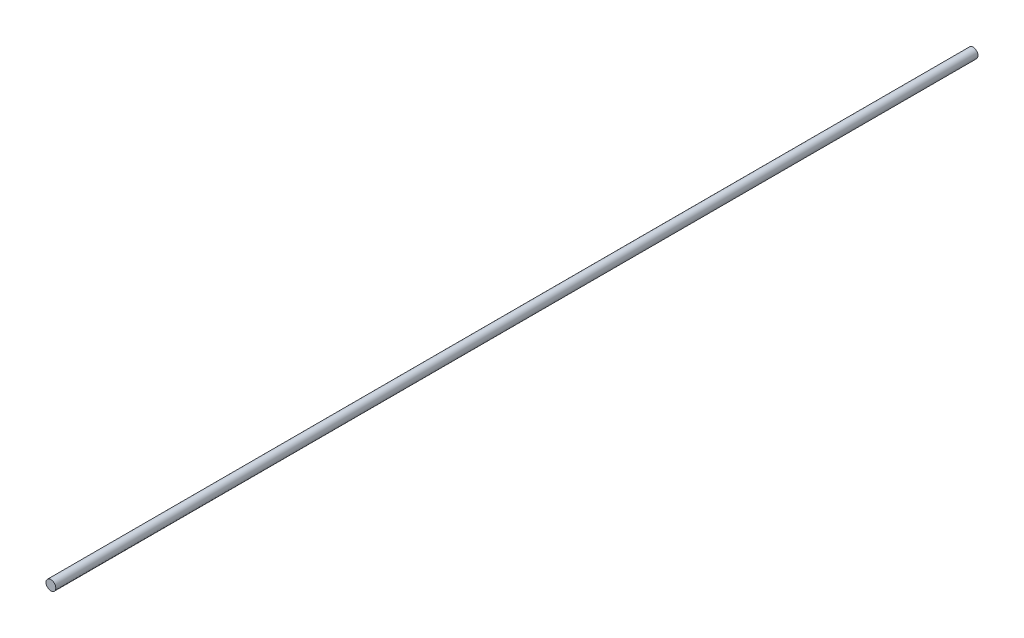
ISO-10303-21;
HEADER;
FILE_DESCRIPTION(('STEP AP214'),'2;1');
FILE_NAME('part.step','',(''),(''),'','','');
FILE_SCHEMA(('AUTOMOTIVE_DESIGN { 1 0 10303 214 1 1 1 1 }'));
ENDSEC;
DATA;
#1=APPLICATION_CONTEXT('core data for automotive mechanical design processes');
#2=APPLICATION_PROTOCOL_DEFINITION('international standard','automotive_design',2000,#1);
#3=PRODUCT_CONTEXT('',#1,'mechanical');
#4=PRODUCT('Part','Part','',(#3));
#5=PRODUCT_RELATED_PRODUCT_CATEGORY('part','',(#4));
#6=PRODUCT_DEFINITION_FORMATION('','',#4);
#7=PRODUCT_DEFINITION_CONTEXT('part definition',#1,'design');
#8=PRODUCT_DEFINITION('design','',#6,#7);
#9=PRODUCT_DEFINITION_SHAPE('','',#8);
#10=(LENGTH_UNIT() NAMED_UNIT(*) SI_UNIT(.MILLI.,.METRE.));
#11=(NAMED_UNIT(*) PLANE_ANGLE_UNIT() SI_UNIT($,.RADIAN.));
#12=(NAMED_UNIT(*) SI_UNIT($,.STERADIAN.) SOLID_ANGLE_UNIT());
#13=UNCERTAINTY_MEASURE_WITH_UNIT(LENGTH_MEASURE(1.E-05),#10,'distance_accuracy_value','');
#14=(GEOMETRIC_REPRESENTATION_CONTEXT(3) GLOBAL_UNCERTAINTY_ASSIGNED_CONTEXT((#13)) GLOBAL_UNIT_ASSIGNED_CONTEXT((#10,
#11,#12)) REPRESENTATION_CONTEXT('',''));
#15=CARTESIAN_POINT('',(0.,0.,0.));
#16=DIRECTION('',(0.,0.,1.));
#17=DIRECTION('',(1.,0.,0.));
#18=AXIS2_PLACEMENT_3D('',#15,#16,#17);
#19=CARTESIAN_POINT('',(0.,0.,-5650.));
#20=DIRECTION('',(0.,0.,1.));
#21=DIRECTION('',(1.,0.,0.));
#22=AXIS2_PLACEMENT_3D('',#19,#20,#21);
#23=CYLINDRICAL_SURFACE('',#22,30.);
#24=CARTESIAN_POINT('',(0.,0.,-5650.));
#25=DIRECTION('',(0.,0.,1.));
#26=DIRECTION('',(1.,0.,0.));
#27=AXIS2_PLACEMENT_3D('',#24,#25,#26);
#28=CIRCLE('',#27,30.);
#29=CARTESIAN_POINT('',(30.,0.,-5650.));
#30=VERTEX_POINT('',#29);
#31=EDGE_CURVE('E10',#30,#30,#28,.T.);
#32=ORIENTED_EDGE('',*,*,#31,.T.);
#33=EDGE_LOOP('',(#32));
#34=FACE_BOUND('',#33,.T.);
#35=CARTESIAN_POINT('',(0.,0.,0.));
#36=DIRECTION('',(0.,0.,1.));
#37=DIRECTION('',(1.,0.,0.));
#38=AXIS2_PLACEMENT_3D('',#35,#36,#37);
#39=CIRCLE('',#38,30.);
#40=CARTESIAN_POINT('',(30.,0.,0.));
#41=VERTEX_POINT('',#40);
#42=EDGE_CURVE('E40',#41,#41,#39,.T.);
#43=ORIENTED_EDGE('',*,*,#42,.F.);
#44=EDGE_LOOP('',(#43));
#45=FACE_BOUND('',#44,.T.);
#46=ADVANCED_FACE('F37',(#34,#45),#23,.T.);
#47=CARTESIAN_POINT('',(0.,0.,-5650.));
#48=DIRECTION('',(0.,0.,1.));
#49=DIRECTION('',(1.,0.,0.));
#50=AXIS2_PLACEMENT_3D('',#47,#48,#49);
#51=PLANE('',#50);
#52=ORIENTED_EDGE('',*,*,#31,.F.);
#53=EDGE_LOOP('',(#52));
#54=FACE_BOUND('',#53,.T.);
#55=ADVANCED_FACE('F54',(#54),#51,.F.);
#56=CARTESIAN_POINT('',(0.,0.,0.));
#57=DIRECTION('',(0.,0.,1.));
#58=DIRECTION('',(1.,0.,0.));
#59=AXIS2_PLACEMENT_3D('',#56,#57,#58);
#60=PLANE('',#59);
#61=ORIENTED_EDGE('',*,*,#42,.T.);
#62=EDGE_LOOP('',(#61));
#63=FACE_BOUND('',#62,.T.);
#64=ADVANCED_FACE('F51',(#63),#60,.T.);
#65=CLOSED_SHELL('',(#46,#55,#64));
#66=MANIFOLD_SOLID_BREP('B2',#65);
#67=ADVANCED_BREP_SHAPE_REPRESENTATION('',(#18,#66),#14);
#68=SHAPE_DEFINITION_REPRESENTATION(#9,#67);
ENDSEC;
END-ISO-10303-21;
